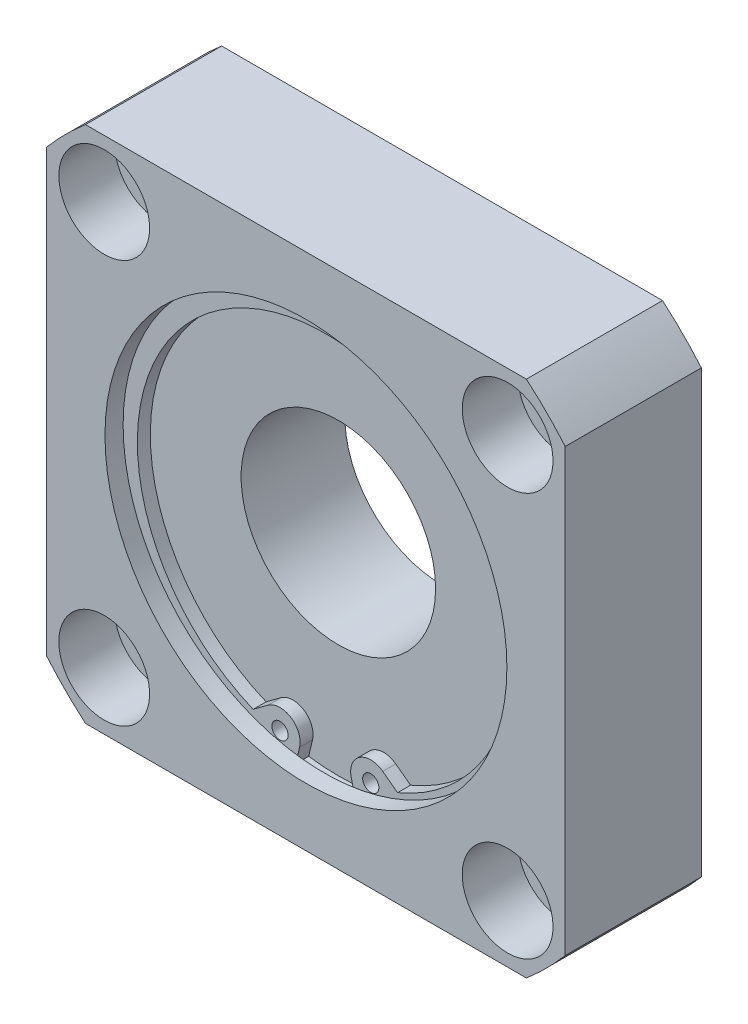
ISO-10303-21;
HEADER;
FILE_DESCRIPTION(('STEP AP214'),'2;1');
FILE_NAME('part.step','',(''),(''),'','','');
FILE_SCHEMA(('AUTOMOTIVE_DESIGN { 1 0 10303 214 1 1 1 1 }'));
ENDSEC;
DATA;
#1=APPLICATION_CONTEXT('core data for automotive mechanical design processes');
#2=APPLICATION_PROTOCOL_DEFINITION('international standard','automotive_design',2000,#1);
#3=PRODUCT_CONTEXT('',#1,'mechanical');
#4=PRODUCT('Part','Part','',(#3));
#5=PRODUCT_RELATED_PRODUCT_CATEGORY('part','',(#4));
#6=PRODUCT_DEFINITION_FORMATION('','',#4);
#7=PRODUCT_DEFINITION_CONTEXT('part definition',#1,'design');
#8=PRODUCT_DEFINITION('design','',#6,#7);
#9=PRODUCT_DEFINITION_SHAPE('','',#8);
#10=(LENGTH_UNIT() NAMED_UNIT(*) SI_UNIT(.MILLI.,.METRE.));
#11=(NAMED_UNIT(*) PLANE_ANGLE_UNIT() SI_UNIT($,.RADIAN.));
#12=(NAMED_UNIT(*) SI_UNIT($,.STERADIAN.) SOLID_ANGLE_UNIT());
#13=UNCERTAINTY_MEASURE_WITH_UNIT(LENGTH_MEASURE(1.E-05),#10,'distance_accuracy_value','');
#14=(GEOMETRIC_REPRESENTATION_CONTEXT(3) GLOBAL_UNCERTAINTY_ASSIGNED_CONTEXT((#13)) GLOBAL_UNIT_ASSIGNED_CONTEXT((#10,
#11,#12)) REPRESENTATION_CONTEXT('',''));
#15=CARTESIAN_POINT('',(0.,0.,0.));
#16=DIRECTION('',(0.,0.,1.));
#17=DIRECTION('',(1.,0.,0.));
#18=AXIS2_PLACEMENT_3D('',#15,#16,#17);
#19=CARTESIAN_POINT('',(31.1126983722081,31.1126983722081,0.));
#20=DIRECTION('',(0.,0.,1.));
#21=DIRECTION('',(1.,0.,0.));
#22=AXIS2_PLACEMENT_3D('',#19,#20,#21);
#23=CYLINDRICAL_SURFACE('',#22,5.);
#24=CARTESIAN_POINT('',(31.1126983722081,31.1126983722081,0.));
#25=DIRECTION('',(0.,0.,1.));
#26=DIRECTION('',(1.,0.,0.));
#27=AXIS2_PLACEMENT_3D('',#24,#25,#26);
#28=CIRCLE('',#27,5.);
#29=CARTESIAN_POINT('',(36.1126983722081,31.1126983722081,0.));
#30=VERTEX_POINT('',#29);
#31=EDGE_CURVE('E287',#30,#30,#28,.T.);
#32=ORIENTED_EDGE('',*,*,#31,.F.);
#33=EDGE_LOOP('',(#32));
#34=FACE_BOUND('',#33,.T.);
#35=CARTESIAN_POINT('',(31.1126983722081,31.1126983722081,12.4));
#36=DIRECTION('',(0.,0.,1.));
#37=DIRECTION('',(1.,0.,0.));
#38=AXIS2_PLACEMENT_3D('',#35,#36,#37);
#39=CIRCLE('',#38,5.);
#40=CARTESIAN_POINT('',(36.1126983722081,31.1126983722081,12.4));
#41=VERTEX_POINT('',#40);
#42=EDGE_CURVE('E286',#41,#41,#39,.F.);
#43=ORIENTED_EDGE('',*,*,#42,.F.);
#44=EDGE_LOOP('',(#43));
#45=FACE_BOUND('',#44,.T.);
#46=ADVANCED_FACE('F14',(#34,#45),#23,.F.);
#47=CARTESIAN_POINT('',(31.112698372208,-31.1126983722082,0.));
#48=DIRECTION('',(0.,0.,1.));
#49=DIRECTION('',(1.,0.,0.));
#50=AXIS2_PLACEMENT_3D('',#47,#48,#49);
#51=CYLINDRICAL_SURFACE('',#50,5.);
#52=CARTESIAN_POINT('',(31.112698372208,-31.1126983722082,0.));
#53=DIRECTION('',(0.,0.,1.));
#54=DIRECTION('',(0.,-1.,0.));
#55=AXIS2_PLACEMENT_3D('',#52,#53,#54);
#56=CIRCLE('',#55,5.);
#57=CARTESIAN_POINT('',(31.112698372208,-36.1126983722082,0.));
#58=VERTEX_POINT('',#57);
#59=EDGE_CURVE('E277',#58,#58,#56,.T.);
#60=ORIENTED_EDGE('',*,*,#59,.F.);
#61=EDGE_LOOP('',(#60));
#62=FACE_BOUND('',#61,.T.);
#63=CARTESIAN_POINT('',(31.112698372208,-31.1126983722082,12.4));
#64=DIRECTION('',(0.,0.,1.));
#65=DIRECTION('',(1.,0.,0.));
#66=AXIS2_PLACEMENT_3D('',#63,#64,#65);
#67=CIRCLE('',#66,5.);
#68=CARTESIAN_POINT('',(36.112698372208,-31.1126983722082,12.4));
#69=VERTEX_POINT('',#68);
#70=EDGE_CURVE('E270',#69,#69,#67,.F.);
#71=ORIENTED_EDGE('',*,*,#70,.F.);
#72=EDGE_LOOP('',(#71));
#73=FACE_BOUND('',#72,.T.);
#74=ADVANCED_FACE('F434',(#62,#73),#51,.F.);
#75=CARTESIAN_POINT('',(-31.1126983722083,-31.1126983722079,0.));
#76=DIRECTION('',(0.,0.,1.));
#77=DIRECTION('',(1.,0.,0.));
#78=AXIS2_PLACEMENT_3D('',#75,#76,#77);
#79=CYLINDRICAL_SURFACE('',#78,5.);
#80=CARTESIAN_POINT('',(-31.1126983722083,-31.1126983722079,0.));
#81=DIRECTION('',(0.,0.,1.));
#82=DIRECTION('',(-1.,0.,0.));
#83=AXIS2_PLACEMENT_3D('',#80,#81,#82);
#84=CIRCLE('',#83,5.);
#85=CARTESIAN_POINT('',(-36.1126983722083,-31.1126983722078,0.));
#86=VERTEX_POINT('',#85);
#87=EDGE_CURVE('E274',#86,#86,#84,.T.);
#88=ORIENTED_EDGE('',*,*,#87,.F.);
#89=EDGE_LOOP('',(#88));
#90=FACE_BOUND('',#89,.T.);
#91=CARTESIAN_POINT('',(-31.1126983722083,-31.1126983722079,12.4));
#92=DIRECTION('',(0.,0.,1.));
#93=DIRECTION('',(1.,0.,0.));
#94=AXIS2_PLACEMENT_3D('',#91,#92,#93);
#95=CIRCLE('',#94,5.);
#96=CARTESIAN_POINT('',(-26.1126983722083,-31.1126983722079,12.4));
#97=VERTEX_POINT('',#96);
#98=EDGE_CURVE('E263',#97,#97,#95,.F.);
#99=ORIENTED_EDGE('',*,*,#98,.F.);
#100=EDGE_LOOP('',(#99));
#101=FACE_BOUND('',#100,.T.);
#102=ADVANCED_FACE('F440',(#90,#101),#79,.F.);
#103=CARTESIAN_POINT('',(-31.1126983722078,31.1126983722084,0.));
#104=DIRECTION('',(0.,0.,1.));
#105=DIRECTION('',(1.,0.,0.));
#106=AXIS2_PLACEMENT_3D('',#103,#104,#105);
#107=CYLINDRICAL_SURFACE('',#106,5.);
#108=CARTESIAN_POINT('',(-31.1126983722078,31.1126983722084,0.));
#109=DIRECTION('',(0.,0.,1.));
#110=DIRECTION('',(0.,1.,0.));
#111=AXIS2_PLACEMENT_3D('',#108,#109,#110);
#112=CIRCLE('',#111,5.);
#113=CARTESIAN_POINT('',(-31.1126983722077,36.1126983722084,0.));
#114=VERTEX_POINT('',#113);
#115=EDGE_CURVE('E271',#114,#114,#112,.T.);
#116=ORIENTED_EDGE('',*,*,#115,.F.);
#117=EDGE_LOOP('',(#116));
#118=FACE_BOUND('',#117,.T.);
#119=CARTESIAN_POINT('',(-31.1126983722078,31.1126983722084,12.4));
#120=DIRECTION('',(0.,0.,1.));
#121=DIRECTION('',(1.,0.,0.));
#122=AXIS2_PLACEMENT_3D('',#119,#120,#121);
#123=CIRCLE('',#122,5.);
#124=CARTESIAN_POINT('',(-26.1126983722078,31.1126983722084,12.4));
#125=VERTEX_POINT('',#124);
#126=EDGE_CURVE('E256',#125,#125,#123,.F.);
#127=ORIENTED_EDGE('',*,*,#126,.F.);
#128=EDGE_LOOP('',(#127));
#129=FACE_BOUND('',#128,.T.);
#130=ADVANCED_FACE('F801',(#118,#129),#107,.F.);
#131=CARTESIAN_POINT('',(0.,0.,-5.));
#132=DIRECTION('',(0.,0.,1.));
#133=DIRECTION('',(1.,0.,0.));
#134=AXIS2_PLACEMENT_3D('',#131,#132,#133);
#135=CYLINDRICAL_SURFACE('',#134,35.);
#136=CARTESIAN_POINT('',(0.,0.,-5.));
#137=DIRECTION('',(0.,0.,-1.));
#138=DIRECTION('',(-1.,0.,0.));
#139=AXIS2_PLACEMENT_3D('',#136,#137,#138);
#140=CIRCLE('',#139,35.);
#141=CARTESIAN_POINT('',(-35.,0.,-5.));
#142=VERTEX_POINT('',#141);
#143=EDGE_CURVE('E238',#142,#142,#140,.T.);
#144=ORIENTED_EDGE('',*,*,#143,.F.);
#145=EDGE_LOOP('',(#144));
#146=FACE_BOUND('',#145,.T.);
#147=CARTESIAN_POINT('',(0.,0.,0.));
#148=DIRECTION('',(0.,0.,-1.));
#149=DIRECTION('',(-1.,0.,0.));
#150=AXIS2_PLACEMENT_3D('',#147,#148,#149);
#151=CIRCLE('',#150,35.);
#152=CARTESIAN_POINT('',(-35.,0.,0.));
#153=VERTEX_POINT('',#152);
#154=EDGE_CURVE('E239',#153,#153,#151,.T.);
#155=ORIENTED_EDGE('',*,*,#154,.T.);
#156=EDGE_LOOP('',(#155));
#157=FACE_BOUND('',#156,.T.);
#158=ADVANCED_FACE('F458',(#146,#157),#135,.T.);
#159=CARTESIAN_POINT('',(0.,0.,0.));
#160=DIRECTION('',(0.,0.,-1.));
#161=DIRECTION('',(-1.,0.,0.));
#162=AXIS2_PLACEMENT_3D('',#159,#160,#161);
#163=PLANE('',#162);
#164=ORIENTED_EDGE('',*,*,#154,.F.);
#165=EDGE_LOOP('',(#164));
#166=FACE_BOUND('',#165,.T.);
#167=ORIENTED_EDGE('',*,*,#115,.T.);
#168=EDGE_LOOP('',(#167));
#169=FACE_BOUND('',#168,.T.);
#170=ORIENTED_EDGE('',*,*,#87,.T.);
#171=EDGE_LOOP('',(#170));
#172=FACE_BOUND('',#171,.T.);
#173=ORIENTED_EDGE('',*,*,#59,.T.);
#174=EDGE_LOOP('',(#173));
#175=FACE_BOUND('',#174,.T.);
#176=ORIENTED_EDGE('',*,*,#31,.T.);
#177=EDGE_LOOP('',(#176));
#178=FACE_BOUND('',#177,.T.);
#179=CARTESIAN_POINT('',(0.,0.,0.));
#180=DIRECTION('',(0.,0.,-1.));
#181=DIRECTION('',(-1.,0.,0.));
#182=AXIS2_PLACEMENT_3D('',#179,#180,#181);
#183=CIRCLE('',#182,52.5);
#184=CARTESIAN_POINT('',(40.,-34.0036762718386,0.));
#185=VERTEX_POINT('',#184);
#186=CARTESIAN_POINT('',(34.0036762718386,-40.,0.));
#187=VERTEX_POINT('',#186);
#188=EDGE_CURVE('E293',#185,#187,#183,.T.);
#189=ORIENTED_EDGE('',*,*,#188,.T.);
#190=DIRECTION('',(1.,0.,0.));
#191=VECTOR('',#190,1.);
#192=CARTESIAN_POINT('',(-34.0036762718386,-40.,0.));
#193=LINE('',#192,#191);
#194=CARTESIAN_POINT('',(-34.0036762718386,-40.,0.));
#195=VERTEX_POINT('',#194);
#196=EDGE_CURVE('E295',#195,#187,#193,.T.);
#197=ORIENTED_EDGE('',*,*,#196,.F.);
#198=CARTESIAN_POINT('',(0.,0.,0.));
#199=DIRECTION('',(0.,0.,1.));
#200=DIRECTION('',(1.,0.,0.));
#201=AXIS2_PLACEMENT_3D('',#198,#199,#200);
#202=CIRCLE('',#201,52.5);
#203=CARTESIAN_POINT('',(-40.,-34.0036762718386,0.));
#204=VERTEX_POINT('',#203);
#205=EDGE_CURVE('E298',#204,#195,#202,.T.);
#206=ORIENTED_EDGE('',*,*,#205,.F.);
#207=DIRECTION('',(0.,-1.,0.));
#208=VECTOR('',#207,1.);
#209=CARTESIAN_POINT('',(-40.,34.0036762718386,0.));
#210=LINE('',#209,#208);
#211=CARTESIAN_POINT('',(-40.,34.0036762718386,0.));
#212=VERTEX_POINT('',#211);
#213=EDGE_CURVE('E301',#212,#204,#210,.T.);
#214=ORIENTED_EDGE('',*,*,#213,.F.);
#215=CARTESIAN_POINT('',(0.,0.,0.));
#216=DIRECTION('',(0.,0.,-1.));
#217=DIRECTION('',(-1.,0.,0.));
#218=AXIS2_PLACEMENT_3D('',#215,#216,#217);
#219=CIRCLE('',#218,52.5);
#220=CARTESIAN_POINT('',(-34.0036762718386,40.,0.));
#221=VERTEX_POINT('',#220);
#222=EDGE_CURVE('E304',#212,#221,#219,.T.);
#223=ORIENTED_EDGE('',*,*,#222,.T.);
#224=DIRECTION('',(1.,0.,0.));
#225=VECTOR('',#224,1.);
#226=CARTESIAN_POINT('',(-34.0036762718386,40.,0.));
#227=LINE('',#226,#225);
#228=CARTESIAN_POINT('',(34.0036762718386,40.,0.));
#229=VERTEX_POINT('',#228);
#230=EDGE_CURVE('E307',#221,#229,#227,.T.);
#231=ORIENTED_EDGE('',*,*,#230,.T.);
#232=CARTESIAN_POINT('',(0.,0.,0.));
#233=DIRECTION('',(0.,0.,1.));
#234=DIRECTION('',(1.,0.,0.));
#235=AXIS2_PLACEMENT_3D('',#232,#233,#234);
#236=CIRCLE('',#235,52.5);
#237=CARTESIAN_POINT('',(40.,34.0036762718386,0.));
#238=VERTEX_POINT('',#237);
#239=EDGE_CURVE('E310',#238,#229,#236,.T.);
#240=ORIENTED_EDGE('',*,*,#239,.F.);
#241=DIRECTION('',(0.,-1.,0.));
#242=VECTOR('',#241,1.);
#243=CARTESIAN_POINT('',(40.,34.0036762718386,0.));
#244=LINE('',#243,#242);
#245=EDGE_CURVE('E313',#238,#185,#244,.T.);
#246=ORIENTED_EDGE('',*,*,#245,.T.);
#247=EDGE_LOOP('',(#189,#197,#206,#214,#223,#231,#240,#246));
#248=FACE_BOUND('',#247,.T.);
#249=ADVANCED_FACE('F454',(#166,#169,#172,#175,#178,#248),#163,.T.);
#250=CARTESIAN_POINT('',(31.1126983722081,31.1126983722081,12.4));
#251=DIRECTION('',(0.,0.,1.));
#252=DIRECTION('',(1.,0.,0.));
#253=AXIS2_PLACEMENT_3D('',#250,#251,#252);
#254=PLANE('',#253);
#255=CARTESIAN_POINT('',(31.1126983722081,31.1126983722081,12.4));
#256=DIRECTION('',(0.,0.,1.));
#257=DIRECTION('',(1.,0.,0.));
#258=AXIS2_PLACEMENT_3D('',#255,#256,#257);
#259=CIRCLE('',#258,7.);
#260=CARTESIAN_POINT('',(38.1126983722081,31.1126983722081,12.4));
#261=VERTEX_POINT('',#260);
#262=EDGE_CURVE('E283',#261,#261,#259,.T.);
#263=ORIENTED_EDGE('',*,*,#262,.T.);
#264=EDGE_LOOP('',(#263));
#265=FACE_BOUND('',#264,.T.);
#266=ORIENTED_EDGE('',*,*,#42,.T.);
#267=EDGE_LOOP('',(#266));
#268=FACE_BOUND('',#267,.T.);
#269=ADVANCED_FACE('F457',(#265,#268),#254,.T.);
#270=CARTESIAN_POINT('',(31.112698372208,-31.1126983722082,12.4));
#271=DIRECTION('',(0.,0.,1.));
#272=DIRECTION('',(0.,-1.,0.));
#273=AXIS2_PLACEMENT_3D('',#270,#271,#272);
#274=PLANE('',#273);
#275=CARTESIAN_POINT('',(31.112698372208,-31.1126983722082,12.4));
#276=DIRECTION('',(0.,0.,1.));
#277=DIRECTION('',(0.,-1.,0.));
#278=AXIS2_PLACEMENT_3D('',#275,#276,#277);
#279=CIRCLE('',#278,7.);
#280=CARTESIAN_POINT('',(31.112698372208,-38.1126983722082,12.4));
#281=VERTEX_POINT('',#280);
#282=EDGE_CURVE('E267',#281,#281,#279,.T.);
#283=ORIENTED_EDGE('',*,*,#282,.T.);
#284=EDGE_LOOP('',(#283));
#285=FACE_BOUND('',#284,.T.);
#286=ORIENTED_EDGE('',*,*,#70,.T.);
#287=EDGE_LOOP('',(#286));
#288=FACE_BOUND('',#287,.T.);
#289=ADVANCED_FACE('F772',(#285,#288),#274,.T.);
#290=CARTESIAN_POINT('',(-31.1126983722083,-31.1126983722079,12.4));
#291=DIRECTION('',(0.,0.,1.));
#292=DIRECTION('',(-1.,0.,0.));
#293=AXIS2_PLACEMENT_3D('',#290,#291,#292);
#294=PLANE('',#293);
#295=CARTESIAN_POINT('',(-31.1126983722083,-31.1126983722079,12.4));
#296=DIRECTION('',(0.,0.,1.));
#297=DIRECTION('',(-1.,0.,0.));
#298=AXIS2_PLACEMENT_3D('',#295,#296,#297);
#299=CIRCLE('',#298,7.);
#300=CARTESIAN_POINT('',(-38.1126983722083,-31.1126983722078,12.4));
#301=VERTEX_POINT('',#300);
#302=EDGE_CURVE('E260',#301,#301,#299,.T.);
#303=ORIENTED_EDGE('',*,*,#302,.T.);
#304=EDGE_LOOP('',(#303));
#305=FACE_BOUND('',#304,.T.);
#306=ORIENTED_EDGE('',*,*,#98,.T.);
#307=EDGE_LOOP('',(#306));
#308=FACE_BOUND('',#307,.T.);
#309=ADVANCED_FACE('F763',(#305,#308),#294,.T.);
#310=CARTESIAN_POINT('',(-31.1126983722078,31.1126983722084,12.4));
#311=DIRECTION('',(0.,0.,1.));
#312=DIRECTION('',(0.,1.,0.));
#313=AXIS2_PLACEMENT_3D('',#310,#311,#312);
#314=PLANE('',#313);
#315=CARTESIAN_POINT('',(-31.1126983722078,31.1126983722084,12.4));
#316=DIRECTION('',(0.,0.,1.));
#317=DIRECTION('',(0.,1.,0.));
#318=AXIS2_PLACEMENT_3D('',#315,#316,#317);
#319=CIRCLE('',#318,7.);
#320=CARTESIAN_POINT('',(-31.1126983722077,38.1126983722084,12.4));
#321=VERTEX_POINT('',#320);
#322=EDGE_CURVE('E253',#321,#321,#319,.T.);
#323=ORIENTED_EDGE('',*,*,#322,.T.);
#324=EDGE_LOOP('',(#323));
#325=FACE_BOUND('',#324,.T.);
#326=ORIENTED_EDGE('',*,*,#126,.T.);
#327=EDGE_LOOP('',(#326));
#328=FACE_BOUND('',#327,.T.);
#329=ADVANCED_FACE('F754',(#325,#328),#314,.T.);
#330=CARTESIAN_POINT('',(0.,0.,-5.));
#331=DIRECTION('',(0.,0.,-1.));
#332=DIRECTION('',(-1.,0.,0.));
#333=AXIS2_PLACEMENT_3D('',#330,#331,#332);
#334=PLANE('',#333);
#335=ORIENTED_EDGE('',*,*,#143,.T.);
#336=EDGE_LOOP('',(#335));
#337=FACE_BOUND('',#336,.T.);
#338=CARTESIAN_POINT('',(0.,0.,-5.));
#339=DIRECTION('',(0.,0.,-1.));
#340=DIRECTION('',(-1.,0.,0.));
#341=AXIS2_PLACEMENT_3D('',#338,#339,#340);
#342=CIRCLE('',#341,27.5);
#343=CARTESIAN_POINT('',(-27.5,0.,-5.));
#344=VERTEX_POINT('',#343);
#345=EDGE_CURVE('E235',#344,#344,#342,.T.);
#346=ORIENTED_EDGE('',*,*,#345,.F.);
#347=EDGE_LOOP('',(#346));
#348=FACE_BOUND('',#347,.T.);
#349=ADVANCED_FACE('F474',(#337,#348),#334,.T.);
#350=CARTESIAN_POINT('',(-34.0036762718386,-40.,21.));
#351=DIRECTION('',(0.,1.,0.));
#352=DIRECTION('',(0.,0.,1.));
#353=AXIS2_PLACEMENT_3D('',#350,#351,#352);
#354=PLANE('',#353);
#355=DIRECTION('',(1.,0.,0.));
#356=VECTOR('',#355,1.);
#357=CARTESIAN_POINT('',(-34.0036762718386,-40.,21.));
#358=LINE('',#357,#356);
#359=CARTESIAN_POINT('',(-34.0036762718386,-40.,21.));
#360=VERTEX_POINT('',#359);
#361=CARTESIAN_POINT('',(34.0036762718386,-40.,21.));
#362=VERTEX_POINT('',#361);
#363=EDGE_CURVE('E318',#360,#362,#358,.T.);
#364=ORIENTED_EDGE('',*,*,#363,.F.);
#365=DIRECTION('',(0.,0.,-1.));
#366=VECTOR('',#365,1.);
#367=CARTESIAN_POINT('',(-34.0036762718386,-40.,21.));
#368=LINE('',#367,#366);
#369=EDGE_CURVE('E340',#360,#195,#368,.T.);
#370=ORIENTED_EDGE('',*,*,#369,.T.);
#371=ORIENTED_EDGE('',*,*,#196,.T.);
#372=DIRECTION('',(0.,0.,-1.));
#373=VECTOR('',#372,1.);
#374=CARTESIAN_POINT('',(34.0036762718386,-40.,21.));
#375=LINE('',#374,#373);
#376=EDGE_CURVE('E74',#362,#187,#375,.T.);
#377=ORIENTED_EDGE('',*,*,#376,.F.);
#378=EDGE_LOOP('',(#364,#370,#371,#377));
#379=FACE_BOUND('',#378,.T.);
#380=ADVANCED_FACE('F470',(#379),#354,.F.);
#381=CARTESIAN_POINT('',(0.,0.,21.));
#382=DIRECTION('',(0.,0.,-1.));
#383=DIRECTION('',(-1.,0.,0.));
#384=AXIS2_PLACEMENT_3D('',#381,#382,#383);
#385=CYLINDRICAL_SURFACE('',#384,52.5);
#386=ORIENTED_EDGE('',*,*,#369,.F.);
#387=CARTESIAN_POINT('',(0.,0.,21.));
#388=DIRECTION('',(0.,0.,1.));
#389=DIRECTION('',(1.,0.,0.));
#390=AXIS2_PLACEMENT_3D('',#387,#388,#389);
#391=CIRCLE('',#390,52.5);
#392=CARTESIAN_POINT('',(-40.,-34.0036762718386,21.));
#393=VERTEX_POINT('',#392);
#394=EDGE_CURVE('E321',#393,#360,#391,.T.);
#395=ORIENTED_EDGE('',*,*,#394,.F.);
#396=DIRECTION('',(0.,0.,-1.));
#397=VECTOR('',#396,1.);
#398=CARTESIAN_POINT('',(-40.,-34.0036762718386,21.));
#399=LINE('',#398,#397);
#400=EDGE_CURVE('E342',#393,#204,#399,.T.);
#401=ORIENTED_EDGE('',*,*,#400,.T.);
#402=ORIENTED_EDGE('',*,*,#205,.T.);
#403=EDGE_LOOP('',(#386,#395,#401,#402));
#404=FACE_BOUND('',#403,.T.);
#405=ADVANCED_FACE('F473',(#404),#385,.T.);
#406=CARTESIAN_POINT('',(-40.,34.0036762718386,21.));
#407=DIRECTION('',(1.,0.,0.));
#408=DIRECTION('',(0.,0.,-1.));
#409=AXIS2_PLACEMENT_3D('',#406,#407,#408);
#410=PLANE('',#409);
#411=ORIENTED_EDGE('',*,*,#400,.F.);
#412=DIRECTION('',(0.,-1.,0.));
#413=VECTOR('',#412,1.);
#414=CARTESIAN_POINT('',(-40.,34.0036762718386,21.));
#415=LINE('',#414,#413);
#416=CARTESIAN_POINT('',(-40.,34.0036762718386,21.));
#417=VERTEX_POINT('',#416);
#418=EDGE_CURVE('E324',#417,#393,#415,.T.);
#419=ORIENTED_EDGE('',*,*,#418,.F.);
#420=DIRECTION('',(0.,0.,-1.));
#421=VECTOR('',#420,1.);
#422=CARTESIAN_POINT('',(-40.,34.0036762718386,21.));
#423=LINE('',#422,#421);
#424=EDGE_CURVE('E344',#417,#212,#423,.T.);
#425=ORIENTED_EDGE('',*,*,#424,.T.);
#426=ORIENTED_EDGE('',*,*,#213,.T.);
#427=EDGE_LOOP('',(#411,#419,#425,#426));
#428=FACE_BOUND('',#427,.T.);
#429=ADVANCED_FACE('F478',(#428),#410,.F.);
#430=CARTESIAN_POINT('',(0.,0.,21.));
#431=DIRECTION('',(0.,0.,-1.));
#432=DIRECTION('',(-1.,0.,0.));
#433=AXIS2_PLACEMENT_3D('',#430,#431,#432);
#434=CYLINDRICAL_SURFACE('',#433,52.5);
#435=ORIENTED_EDGE('',*,*,#424,.F.);
#436=CARTESIAN_POINT('',(0.,0.,21.));
#437=DIRECTION('',(0.,0.,-1.));
#438=DIRECTION('',(-1.,0.,0.));
#439=AXIS2_PLACEMENT_3D('',#436,#437,#438);
#440=CIRCLE('',#439,52.5);
#441=CARTESIAN_POINT('',(-34.0036762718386,40.,21.));
#442=VERTEX_POINT('',#441);
#443=EDGE_CURVE('E327',#417,#442,#440,.T.);
#444=ORIENTED_EDGE('',*,*,#443,.T.);
#445=DIRECTION('',(0.,0.,-1.));
#446=VECTOR('',#445,1.);
#447=CARTESIAN_POINT('',(-34.0036762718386,40.,21.));
#448=LINE('',#447,#446);
#449=EDGE_CURVE('E346',#442,#221,#448,.T.);
#450=ORIENTED_EDGE('',*,*,#449,.T.);
#451=ORIENTED_EDGE('',*,*,#222,.F.);
#452=EDGE_LOOP('',(#435,#444,#450,#451));
#453=FACE_BOUND('',#452,.T.);
#454=ADVANCED_FACE('F482',(#453),#434,.T.);
#455=CARTESIAN_POINT('',(-34.0036762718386,40.,21.));
#456=DIRECTION('',(0.,1.,0.));
#457=DIRECTION('',(0.,0.,1.));
#458=AXIS2_PLACEMENT_3D('',#455,#456,#457);
#459=PLANE('',#458);
#460=ORIENTED_EDGE('',*,*,#449,.F.);
#461=DIRECTION('',(1.,0.,0.));
#462=VECTOR('',#461,1.);
#463=CARTESIAN_POINT('',(-34.0036762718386,40.,21.));
#464=LINE('',#463,#462);
#465=CARTESIAN_POINT('',(34.0036762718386,40.,21.));
#466=VERTEX_POINT('',#465);
#467=EDGE_CURVE('E330',#442,#466,#464,.T.);
#468=ORIENTED_EDGE('',*,*,#467,.T.);
#469=DIRECTION('',(0.,0.,-1.));
#470=VECTOR('',#469,1.);
#471=CARTESIAN_POINT('',(34.0036762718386,40.,21.));
#472=LINE('',#471,#470);
#473=EDGE_CURVE('E348',#466,#229,#472,.T.);
#474=ORIENTED_EDGE('',*,*,#473,.T.);
#475=ORIENTED_EDGE('',*,*,#230,.F.);
#476=EDGE_LOOP('',(#460,#468,#474,#475));
#477=FACE_BOUND('',#476,.T.);
#478=ADVANCED_FACE('F486',(#477),#459,.T.);
#479=CARTESIAN_POINT('',(0.,0.,21.));
#480=DIRECTION('',(0.,0.,-1.));
#481=DIRECTION('',(-1.,0.,0.));
#482=AXIS2_PLACEMENT_3D('',#479,#480,#481);
#483=CYLINDRICAL_SURFACE('',#482,52.5);
#484=ORIENTED_EDGE('',*,*,#473,.F.);
#485=CARTESIAN_POINT('',(0.,0.,21.));
#486=DIRECTION('',(0.,0.,1.));
#487=DIRECTION('',(1.,0.,0.));
#488=AXIS2_PLACEMENT_3D('',#485,#486,#487);
#489=CIRCLE('',#488,52.5);
#490=CARTESIAN_POINT('',(40.,34.0036762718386,21.));
#491=VERTEX_POINT('',#490);
#492=EDGE_CURVE('E333',#491,#466,#489,.T.);
#493=ORIENTED_EDGE('',*,*,#492,.F.);
#494=DIRECTION('',(0.,0.,-1.));
#495=VECTOR('',#494,1.);
#496=CARTESIAN_POINT('',(40.,34.0036762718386,21.));
#497=LINE('',#496,#495);
#498=EDGE_CURVE('E350',#491,#238,#497,.T.);
#499=ORIENTED_EDGE('',*,*,#498,.T.);
#500=ORIENTED_EDGE('',*,*,#239,.T.);
#501=EDGE_LOOP('',(#484,#493,#499,#500));
#502=FACE_BOUND('',#501,.T.);
#503=ADVANCED_FACE('F490',(#502),#483,.T.);
#504=CARTESIAN_POINT('',(40.,34.0036762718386,21.));
#505=DIRECTION('',(1.,0.,0.));
#506=DIRECTION('',(0.,0.,-1.));
#507=AXIS2_PLACEMENT_3D('',#504,#505,#506);
#508=PLANE('',#507);
#509=ORIENTED_EDGE('',*,*,#498,.F.);
#510=DIRECTION('',(0.,-1.,0.));
#511=VECTOR('',#510,1.);
#512=CARTESIAN_POINT('',(40.,34.0036762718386,21.));
#513=LINE('',#512,#511);
#514=CARTESIAN_POINT('',(40.,-34.0036762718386,21.));
#515=VERTEX_POINT('',#514);
#516=EDGE_CURVE('E336',#491,#515,#513,.T.);
#517=ORIENTED_EDGE('',*,*,#516,.T.);
#518=DIRECTION('',(0.,0.,-1.));
#519=VECTOR('',#518,1.);
#520=CARTESIAN_POINT('',(40.,-34.0036762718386,21.));
#521=LINE('',#520,#519);
#522=EDGE_CURVE('E243',#515,#185,#521,.T.);
#523=ORIENTED_EDGE('',*,*,#522,.T.);
#524=ORIENTED_EDGE('',*,*,#245,.F.);
#525=EDGE_LOOP('',(#509,#517,#523,#524));
#526=FACE_BOUND('',#525,.T.);
#527=ADVANCED_FACE('F469',(#526),#508,.T.);
#528=CARTESIAN_POINT('',(0.,0.,21.));
#529=DIRECTION('',(0.,0.,-1.));
#530=DIRECTION('',(-1.,0.,0.));
#531=AXIS2_PLACEMENT_3D('',#528,#529,#530);
#532=CYLINDRICAL_SURFACE('',#531,52.5);
#533=ORIENTED_EDGE('',*,*,#522,.F.);
#534=CARTESIAN_POINT('',(0.,0.,21.));
#535=DIRECTION('',(0.,0.,-1.));
#536=DIRECTION('',(-1.,0.,0.));
#537=AXIS2_PLACEMENT_3D('',#534,#535,#536);
#538=CIRCLE('',#537,52.5);
#539=EDGE_CURVE('E316',#515,#362,#538,.T.);
#540=ORIENTED_EDGE('',*,*,#539,.T.);
#541=ORIENTED_EDGE('',*,*,#376,.T.);
#542=ORIENTED_EDGE('',*,*,#188,.F.);
#543=EDGE_LOOP('',(#533,#540,#541,#542));
#544=FACE_BOUND('',#543,.T.);
#545=ADVANCED_FACE('F466',(#544),#532,.T.);
#546=CARTESIAN_POINT('',(31.1126983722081,31.1126983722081,12.4));
#547=DIRECTION('',(0.,0.,1.));
#548=DIRECTION('',(1.,0.,0.));
#549=AXIS2_PLACEMENT_3D('',#546,#547,#548);
#550=CYLINDRICAL_SURFACE('',#549,7.);
#551=ORIENTED_EDGE('',*,*,#262,.F.);
#552=EDGE_LOOP('',(#551));
#553=FACE_BOUND('',#552,.T.);
#554=CARTESIAN_POINT('',(31.1126983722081,31.1126983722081,21.));
#555=DIRECTION('',(0.,0.,1.));
#556=DIRECTION('',(1.,0.,0.));
#557=AXIS2_PLACEMENT_3D('',#554,#555,#556);
#558=CIRCLE('',#557,7.);
#559=CARTESIAN_POINT('',(38.1126983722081,31.1126983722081,21.));
#560=VERTEX_POINT('',#559);
#561=EDGE_CURVE('E280',#560,#560,#558,.T.);
#562=ORIENTED_EDGE('',*,*,#561,.T.);
#563=EDGE_LOOP('',(#562));
#564=FACE_BOUND('',#563,.T.);
#565=ADVANCED_FACE('F447',(#553,#564),#550,.F.);
#566=CARTESIAN_POINT('',(31.112698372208,-31.1126983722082,12.4));
#567=DIRECTION('',(0.,0.,1.));
#568=DIRECTION('',(1.,0.,0.));
#569=AXIS2_PLACEMENT_3D('',#566,#567,#568);
#570=CYLINDRICAL_SURFACE('',#569,7.);
#571=ORIENTED_EDGE('',*,*,#282,.F.);
#572=EDGE_LOOP('',(#571));
#573=FACE_BOUND('',#572,.T.);
#574=CARTESIAN_POINT('',(31.112698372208,-31.1126983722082,21.));
#575=DIRECTION('',(0.,0.,1.));
#576=DIRECTION('',(0.,-1.,0.));
#577=AXIS2_PLACEMENT_3D('',#574,#575,#576);
#578=CIRCLE('',#577,7.);
#579=CARTESIAN_POINT('',(31.112698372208,-38.1126983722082,21.));
#580=VERTEX_POINT('',#579);
#581=EDGE_CURVE('E264',#580,#580,#578,.T.);
#582=ORIENTED_EDGE('',*,*,#581,.T.);
#583=EDGE_LOOP('',(#582));
#584=FACE_BOUND('',#583,.T.);
#585=ADVANCED_FACE('F678',(#573,#584),#570,.F.);
#586=CARTESIAN_POINT('',(-31.1126983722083,-31.1126983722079,12.4));
#587=DIRECTION('',(0.,0.,1.));
#588=DIRECTION('',(1.,0.,0.));
#589=AXIS2_PLACEMENT_3D('',#586,#587,#588);
#590=CYLINDRICAL_SURFACE('',#589,7.);
#591=ORIENTED_EDGE('',*,*,#302,.F.);
#592=EDGE_LOOP('',(#591));
#593=FACE_BOUND('',#592,.T.);
#594=CARTESIAN_POINT('',(-31.1126983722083,-31.1126983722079,21.));
#595=DIRECTION('',(0.,0.,1.));
#596=DIRECTION('',(-1.,0.,0.));
#597=AXIS2_PLACEMENT_3D('',#594,#595,#596);
#598=CIRCLE('',#597,7.);
#599=CARTESIAN_POINT('',(-38.1126983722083,-31.1126983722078,21.));
#600=VERTEX_POINT('',#599);
#601=EDGE_CURVE('E257',#600,#600,#598,.T.);
#602=ORIENTED_EDGE('',*,*,#601,.T.);
#603=EDGE_LOOP('',(#602));
#604=FACE_BOUND('',#603,.T.);
#605=ADVANCED_FACE('F666',(#593,#604),#590,.F.);
#606=CARTESIAN_POINT('',(-31.1126983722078,31.1126983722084,12.4));
#607=DIRECTION('',(0.,0.,1.));
#608=DIRECTION('',(1.,0.,0.));
#609=AXIS2_PLACEMENT_3D('',#606,#607,#608);
#610=CYLINDRICAL_SURFACE('',#609,7.);
#611=ORIENTED_EDGE('',*,*,#322,.F.);
#612=EDGE_LOOP('',(#611));
#613=FACE_BOUND('',#612,.T.);
#614=CARTESIAN_POINT('',(-31.1126983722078,31.1126983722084,21.));
#615=DIRECTION('',(0.,0.,1.));
#616=DIRECTION('',(0.,1.,0.));
#617=AXIS2_PLACEMENT_3D('',#614,#615,#616);
#618=CIRCLE('',#617,7.);
#619=CARTESIAN_POINT('',(-31.1126983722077,38.1126983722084,21.));
#620=VERTEX_POINT('',#619);
#621=EDGE_CURVE('E250',#620,#620,#618,.T.);
#622=ORIENTED_EDGE('',*,*,#621,.T.);
#623=EDGE_LOOP('',(#622));
#624=FACE_BOUND('',#623,.T.);
#625=ADVANCED_FACE('F655',(#613,#624),#610,.F.);
#626=CARTESIAN_POINT('',(0.,0.,-5.));
#627=DIRECTION('',(0.,0.,1.));
#628=DIRECTION('',(1.,0.,0.));
#629=AXIS2_PLACEMENT_3D('',#626,#627,#628);
#630=CYLINDRICAL_SURFACE('',#629,27.5);
#631=ORIENTED_EDGE('',*,*,#345,.T.);
#632=EDGE_LOOP('',(#631));
#633=FACE_BOUND('',#632,.T.);
#634=CARTESIAN_POINT('',(0.,0.,0.));
#635=DIRECTION('',(0.,0.,-1.));
#636=DIRECTION('',(-1.,0.,0.));
#637=AXIS2_PLACEMENT_3D('',#634,#635,#636);
#638=CIRCLE('',#637,27.5);
#639=CARTESIAN_POINT('',(-27.5,0.,0.));
#640=VERTEX_POINT('',#639);
#641=EDGE_CURVE('E232',#640,#640,#638,.T.);
#642=ORIENTED_EDGE('',*,*,#641,.F.);
#643=EDGE_LOOP('',(#642));
#644=FACE_BOUND('',#643,.T.);
#645=ADVANCED_FACE('F464',(#633,#644),#630,.F.);
#646=CARTESIAN_POINT('',(0.,0.,21.));
#647=DIRECTION('',(0.,0.,-1.));
#648=DIRECTION('',(-1.,0.,0.));
#649=AXIS2_PLACEMENT_3D('',#646,#647,#648);
#650=PLANE('',#649);
#651=CARTESIAN_POINT('',(0.,0.,21.));
#652=DIRECTION('',(0.,0.,1.));
#653=DIRECTION('',(1.,0.,0.));
#654=AXIS2_PLACEMENT_3D('',#651,#652,#653);
#655=CIRCLE('',#654,31.);
#656=CARTESIAN_POINT('',(31.,0.,21.));
#657=VERTEX_POINT('',#656);
#658=EDGE_CURVE('E246',#657,#657,#655,.T.);
#659=ORIENTED_EDGE('',*,*,#658,.F.);
#660=EDGE_LOOP('',(#659));
#661=FACE_BOUND('',#660,.T.);
#662=ORIENTED_EDGE('',*,*,#621,.F.);
#663=EDGE_LOOP('',(#662));
#664=FACE_BOUND('',#663,.T.);
#665=ORIENTED_EDGE('',*,*,#601,.F.);
#666=EDGE_LOOP('',(#665));
#667=FACE_BOUND('',#666,.T.);
#668=ORIENTED_EDGE('',*,*,#581,.F.);
#669=EDGE_LOOP('',(#668));
#670=FACE_BOUND('',#669,.T.);
#671=ORIENTED_EDGE('',*,*,#561,.F.);
#672=EDGE_LOOP('',(#671));
#673=FACE_BOUND('',#672,.T.);
#674=ORIENTED_EDGE('',*,*,#539,.F.);
#675=ORIENTED_EDGE('',*,*,#516,.F.);
#676=ORIENTED_EDGE('',*,*,#492,.T.);
#677=ORIENTED_EDGE('',*,*,#467,.F.);
#678=ORIENTED_EDGE('',*,*,#443,.F.);
#679=ORIENTED_EDGE('',*,*,#418,.T.);
#680=ORIENTED_EDGE('',*,*,#394,.T.);
#681=ORIENTED_EDGE('',*,*,#363,.T.);
#682=EDGE_LOOP('',(#674,#675,#676,#677,#678,#679,#680,#681));
#683=FACE_BOUND('',#682,.T.);
#684=ADVANCED_FACE('F461',(#661,#664,#667,#670,#673,#683),#650,.F.);
#685=CARTESIAN_POINT('',(0.,0.,0.));
#686=DIRECTION('',(0.,0.,1.));
#687=DIRECTION('',(1.,0.,0.));
#688=AXIS2_PLACEMENT_3D('',#685,#686,#687);
#689=CIRCLE('',#688,15.);
#690=CARTESIAN_POINT('',(15.,0.,0.));
#691=VERTEX_POINT('',#690);
#692=EDGE_CURVE('E290',#691,#691,#689,.T.);
#693=ORIENTED_EDGE('',*,*,#692,.T.);
#694=EDGE_LOOP('',(#693));
#695=FACE_BOUND('',#694,.T.);
#696=ORIENTED_EDGE('',*,*,#641,.T.);
#697=EDGE_LOOP('',(#696));
#698=FACE_BOUND('',#697,.T.);
#699=ADVANCED_FACE('F460',(#695,#698),#163,.T.);
#700=CARTESIAN_POINT('',(0.,0.,16.));
#701=DIRECTION('',(0.,0.,1.));
#702=DIRECTION('',(1.,0.,0.));
#703=AXIS2_PLACEMENT_3D('',#700,#701,#702);
#704=CYLINDRICAL_SURFACE('',#703,31.);
#705=CARTESIAN_POINT('',(0.,0.,18.2));
#706=DIRECTION('',(0.,0.,1.));
#707=DIRECTION('',(1.,0.,0.));
#708=AXIS2_PLACEMENT_3D('',#705,#706,#707);
#709=CIRCLE('',#708,31.);
#710=CARTESIAN_POINT('',(31.,0.,18.2));
#711=VERTEX_POINT('',#710);
#712=EDGE_CURVE('E229',#711,#711,#709,.F.);
#713=ORIENTED_EDGE('',*,*,#712,.T.);
#714=EDGE_LOOP('',(#713));
#715=FACE_BOUND('',#714,.T.);
#716=ORIENTED_EDGE('',*,*,#658,.T.);
#717=EDGE_LOOP('',(#716));
#718=FACE_BOUND('',#717,.T.);
#719=ADVANCED_FACE('F452',(#715,#718),#704,.F.);
#720=CARTESIAN_POINT('',(0.,0.,21.));
#721=DIRECTION('',(0.,0.,-1.));
#722=DIRECTION('',(-1.,0.,0.));
#723=AXIS2_PLACEMENT_3D('',#720,#721,#722);
#724=CYLINDRICAL_SURFACE('',#723,15.);
#725=ORIENTED_EDGE('',*,*,#692,.F.);
#726=EDGE_LOOP('',(#725));
#727=FACE_BOUND('',#726,.T.);
#728=CARTESIAN_POINT('',(0.,0.,16.));
#729=DIRECTION('',(0.,0.,1.));
#730=DIRECTION('',(1.,0.,0.));
#731=AXIS2_PLACEMENT_3D('',#728,#729,#730);
#732=CIRCLE('',#731,15.);
#733=CARTESIAN_POINT('',(15.,0.,16.));
#734=VERTEX_POINT('',#733);
#735=EDGE_CURVE('E249',#734,#734,#732,.T.);
#736=ORIENTED_EDGE('',*,*,#735,.T.);
#737=EDGE_LOOP('',(#736));
#738=FACE_BOUND('',#737,.T.);
#739=ADVANCED_FACE('F449',(#727,#738),#724,.F.);
#740=CARTESIAN_POINT('',(0.,0.,16.));
#741=DIRECTION('',(0.,0.,1.));
#742=DIRECTION('',(1.,0.,0.));
#743=AXIS2_PLACEMENT_3D('',#740,#741,#742);
#744=PLANE('',#743);
#745=ORIENTED_EDGE('',*,*,#735,.F.);
#746=EDGE_LOOP('',(#745));
#747=FACE_BOUND('',#746,.T.);
#748=CARTESIAN_POINT('',(0.,0.,16.));
#749=DIRECTION('',(0.,0.,1.));
#750=DIRECTION('',(1.,0.,0.));
#751=AXIS2_PLACEMENT_3D('',#748,#749,#750);
#752=CIRCLE('',#751,32.5);
#753=CARTESIAN_POINT('',(-4.57780651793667,-32.1759799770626,16.));
#754=VERTEX_POINT('',#753);
#755=CARTESIAN_POINT('',(4.57780651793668,-32.1759799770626,16.));
#756=VERTEX_POINT('',#755);
#757=EDGE_CURVE('E219',#754,#756,#752,.T.);
#758=ORIENTED_EDGE('',*,*,#757,.T.);
#759=DIRECTION('',(-0.231349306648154,0.972870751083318,0.));
#760=VECTOR('',#759,1.);
#761=CARTESIAN_POINT('',(-2.90915263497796,-0.691798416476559,16.));
#762=LINE('',#761,#760);
#763=CARTESIAN_POINT('',(3.98410067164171,-29.6793264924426,16.));
#764=VERTEX_POINT('',#763);
#765=EDGE_CURVE('E9',#756,#764,#762,.T.);
#766=ORIENTED_EDGE('',*,*,#765,.T.);
#767=CARTESIAN_POINT('',(7.,-28.9621436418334,16.));
#768=DIRECTION('',(0.,0.,1.));
#769=DIRECTION('',(1.,0.,0.));
#770=AXIS2_PLACEMENT_3D('',#767,#768,#769);
#771=CIRCLE('',#770,3.1);
#772=CARTESIAN_POINT('',(8.84931667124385,-26.4741669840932,16.));
#773=VERTEX_POINT('',#772);
#774=EDGE_CURVE('E25',#773,#764,#771,.T.);
#775=ORIENTED_EDGE('',*,*,#774,.F.);
#776=DIRECTION('',(0.802573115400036,-0.596553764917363,0.));
#777=VECTOR('',#776,1.);
#778=CARTESIAN_POINT('',(-9.52598617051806,-12.8157776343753,16.));
#779=LINE('',#778,#777);
#780=CARTESIAN_POINT('',(11.1384133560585,-28.1756558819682,16.));
#781=VERTEX_POINT('',#780);
#782=EDGE_CURVE('E150',#773,#781,#779,.T.);
#783=ORIENTED_EDGE('',*,*,#782,.T.);
#784=CARTESIAN_POINT('',(0.,-1.4,16.));
#785=DIRECTION('',(0.,0.,1.));
#786=DIRECTION('',(1.,0.,0.));
#787=AXIS2_PLACEMENT_3D('',#784,#785,#786);
#788=CIRCLE('',#787,29.);
#789=CARTESIAN_POINT('',(-11.1384133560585,-28.1756558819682,16.));
#790=VERTEX_POINT('',#789);
#791=EDGE_CURVE('E154',#781,#790,#788,.T.);
#792=ORIENTED_EDGE('',*,*,#791,.T.);
#793=DIRECTION('',(0.802573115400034,0.596553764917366,0.));
#794=VECTOR('',#793,1.);
#795=CARTESIAN_POINT('',(9.52598617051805,-12.8157776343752,16.));
#796=LINE('',#795,#794);
#797=CARTESIAN_POINT('',(-8.84931667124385,-26.4741669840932,16.));
#798=VERTEX_POINT('',#797);
#799=EDGE_CURVE('E168',#790,#798,#796,.T.);
#800=ORIENTED_EDGE('',*,*,#799,.T.);
#801=CARTESIAN_POINT('',(-7.,-28.9621436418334,16.));
#802=DIRECTION('',(0.,0.,1.));
#803=DIRECTION('',(1.,0.,0.));
#804=AXIS2_PLACEMENT_3D('',#801,#802,#803);
#805=CIRCLE('',#804,3.1);
#806=CARTESIAN_POINT('',(-3.98410067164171,-29.6793264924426,16.));
#807=VERTEX_POINT('',#806);
#808=EDGE_CURVE('E379',#807,#798,#805,.T.);
#809=ORIENTED_EDGE('',*,*,#808,.F.);
#810=DIRECTION('',(-0.231349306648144,-0.97287075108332,0.));
#811=VECTOR('',#810,1.);
#812=CARTESIAN_POINT('',(2.90915263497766,-0.691798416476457,16.));
#813=LINE('',#812,#811);
#814=EDGE_CURVE('E382',#807,#754,#813,.T.);
#815=ORIENTED_EDGE('',*,*,#814,.T.);
#816=EDGE_LOOP('',(#758,#766,#775,#783,#792,#800,#809,#815));
#817=FACE_BOUND('',#816,.T.);
#818=ADVANCED_FACE('F153',(#747,#817),#744,.T.);
#819=CARTESIAN_POINT('',(0.,0.,18.2));
#820=DIRECTION('',(0.,0.,1.));
#821=DIRECTION('',(1.,0.,0.));
#822=AXIS2_PLACEMENT_3D('',#819,#820,#821);
#823=PLANE('',#822);
#824=CARTESIAN_POINT('',(0.,0.,18.2));
#825=DIRECTION('',(0.,0.,1.));
#826=DIRECTION('',(1.,0.,0.));
#827=AXIS2_PLACEMENT_3D('',#824,#825,#826);
#828=CIRCLE('',#827,32.5);
#829=CARTESIAN_POINT('',(32.5,0.,18.2));
#830=VERTEX_POINT('',#829);
#831=EDGE_CURVE('E224',#830,#830,#828,.T.);
#832=ORIENTED_EDGE('',*,*,#831,.F.);
#833=EDGE_LOOP('',(#832));
#834=FACE_BOUND('',#833,.T.);
#835=ORIENTED_EDGE('',*,*,#712,.F.);
#836=EDGE_LOOP('',(#835));
#837=FACE_BOUND('',#836,.T.);
#838=ADVANCED_FACE('F594',(#834,#837),#823,.F.);
#839=CARTESIAN_POINT('',(0.,0.,18.2));
#840=DIRECTION('',(0.,0.,-1.));
#841=DIRECTION('',(-1.,0.,0.));
#842=AXIS2_PLACEMENT_3D('',#839,#840,#841);
#843=CYLINDRICAL_SURFACE('',#842,32.5);
#844=ORIENTED_EDGE('',*,*,#831,.T.);
#845=EDGE_LOOP('',(#844));
#846=FACE_BOUND('',#845,.T.);
#847=CARTESIAN_POINT('',(0.,0.,18.));
#848=DIRECTION('',(0.,0.,-1.));
#849=DIRECTION('',(-1.,0.,0.));
#850=AXIS2_PLACEMENT_3D('',#847,#848,#849);
#851=CIRCLE('',#850,32.5);
#852=CARTESIAN_POINT('',(-4.57780651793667,-32.1759799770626,18.));
#853=VERTEX_POINT('',#852);
#854=CARTESIAN_POINT('',(4.57780651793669,-32.1759799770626,18.));
#855=VERTEX_POINT('',#854);
#856=EDGE_CURVE('E366',#853,#855,#851,.T.);
#857=ORIENTED_EDGE('',*,*,#856,.T.);
#858=DIRECTION('',(0.,0.,-1.));
#859=VECTOR('',#858,1.);
#860=CARTESIAN_POINT('',(4.57780651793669,-32.1759799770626,18.2));
#861=LINE('',#860,#859);
#862=EDGE_CURVE('E369',#855,#756,#861,.T.);
#863=ORIENTED_EDGE('',*,*,#862,.T.);
#864=ORIENTED_EDGE('',*,*,#757,.F.);
#865=DIRECTION('',(0.,0.,-1.));
#866=VECTOR('',#865,1.);
#867=CARTESIAN_POINT('',(-4.57780651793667,-32.1759799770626,18.2));
#868=LINE('',#867,#866);
#869=EDGE_CURVE('E242',#754,#853,#868,.F.);
#870=ORIENTED_EDGE('',*,*,#869,.T.);
#871=EDGE_LOOP('',(#857,#863,#864,#870));
#872=FACE_BOUND('',#871,.T.);
#873=ADVANCED_FACE('F401',(#846,#872),#843,.F.);
#874=CARTESIAN_POINT('',(7.,-28.9621436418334,16.));
#875=DIRECTION('',(0.,0.,1.));
#876=DIRECTION('',(1.,0.,0.));
#877=AXIS2_PLACEMENT_3D('',#874,#875,#876);
#878=CIRCLE('',#877,1.25);
#879=CARTESIAN_POINT('',(8.25,-28.9621436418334,16.));
#880=VERTEX_POINT('',#879);
#881=EDGE_CURVE('E371',#880,#880,#878,.T.);
#882=ORIENTED_EDGE('',*,*,#881,.T.);
#883=EDGE_LOOP('',(#882));
#884=FACE_BOUND('',#883,.T.);
#885=ADVANCED_FACE('F428',(#884),#744,.T.);
#886=CARTESIAN_POINT('',(-7.,-28.9621436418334,16.));
#887=DIRECTION('',(0.,0.,1.));
#888=DIRECTION('',(1.,0.,0.));
#889=AXIS2_PLACEMENT_3D('',#886,#887,#888);
#890=CIRCLE('',#889,1.25);
#891=CARTESIAN_POINT('',(-5.75,-28.9621436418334,16.));
#892=VERTEX_POINT('',#891);
#893=EDGE_CURVE('E375',#892,#892,#890,.T.);
#894=ORIENTED_EDGE('',*,*,#893,.T.);
#895=EDGE_LOOP('',(#894));
#896=FACE_BOUND('',#895,.T.);
#897=ADVANCED_FACE('F568',(#896),#744,.T.);
#898=CARTESIAN_POINT('',(8.84931667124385,-26.4741669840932,18.));
#899=DIRECTION('',(-0.596553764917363,-0.802573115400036,0.));
#900=DIRECTION('',(-0.802573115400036,0.596553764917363,0.));
#901=AXIS2_PLACEMENT_3D('',#898,#899,#900);
#902=PLANE('',#901);
#903=ORIENTED_EDGE('',*,*,#782,.F.);
#904=DIRECTION('',(0.,0.,-1.));
#905=VECTOR('',#904,1.);
#906=CARTESIAN_POINT('',(8.84931667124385,-26.4741669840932,18.));
#907=LINE('',#906,#905);
#908=CARTESIAN_POINT('',(8.84931667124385,-26.4741669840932,18.));
#909=VERTEX_POINT('',#908);
#910=EDGE_CURVE('E183',#909,#773,#907,.T.);
#911=ORIENTED_EDGE('',*,*,#910,.F.);
#912=DIRECTION('',(-0.802573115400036,0.596553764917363,0.));
#913=VECTOR('',#912,1.);
#914=CARTESIAN_POINT('',(8.84931667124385,-26.4741669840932,18.));
#915=LINE('',#914,#913);
#916=CARTESIAN_POINT('',(11.1384133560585,-28.1756558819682,18.));
#917=VERTEX_POINT('',#916);
#918=EDGE_CURVE('E171',#917,#909,#915,.T.);
#919=ORIENTED_EDGE('',*,*,#918,.F.);
#920=DIRECTION('',(0.,0.,-1.));
#921=VECTOR('',#920,1.);
#922=CARTESIAN_POINT('',(11.1384133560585,-28.1756558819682,18.));
#923=LINE('',#922,#921);
#924=EDGE_CURVE('E164',#917,#781,#923,.T.);
#925=ORIENTED_EDGE('',*,*,#924,.T.);
#926=EDGE_LOOP('',(#903,#911,#919,#925));
#927=FACE_BOUND('',#926,.T.);
#928=ADVANCED_FACE('F16',(#927),#902,.F.);
#929=CARTESIAN_POINT('',(0.,-1.4,18.));
#930=DIRECTION('',(0.,0.,1.));
#931=DIRECTION('',(-1.,0.,0.));
#932=AXIS2_PLACEMENT_3D('',#929,#930,#931);
#933=CYLINDRICAL_SURFACE('',#932,29.);
#934=ORIENTED_EDGE('',*,*,#791,.F.);
#935=ORIENTED_EDGE('',*,*,#924,.F.);
#936=CARTESIAN_POINT('',(0.,-1.4,18.));
#937=DIRECTION('',(0.,0.,-1.));
#938=DIRECTION('',(0.,-1.,0.));
#939=AXIS2_PLACEMENT_3D('',#936,#937,#938);
#940=CIRCLE('',#939,29.);
#941=CARTESIAN_POINT('',(-11.1384133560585,-28.1756558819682,18.));
#942=VERTEX_POINT('',#941);
#943=EDGE_CURVE('E178',#942,#917,#940,.T.);
#944=ORIENTED_EDGE('',*,*,#943,.F.);
#945=DIRECTION('',(0.,0.,-1.));
#946=VECTOR('',#945,1.);
#947=CARTESIAN_POINT('',(-11.1384133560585,-28.1756558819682,18.));
#948=LINE('',#947,#946);
#949=EDGE_CURVE('E166',#942,#790,#948,.T.);
#950=ORIENTED_EDGE('',*,*,#949,.T.);
#951=EDGE_LOOP('',(#934,#935,#944,#950));
#952=FACE_BOUND('',#951,.T.);
#953=ADVANCED_FACE('F162',(#952),#933,.F.);
#954=CARTESIAN_POINT('',(-8.84931667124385,-26.4741669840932,18.));
#955=DIRECTION('',(0.596553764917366,-0.802573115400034,0.));
#956=DIRECTION('',(0.,0.,-1.));
#957=AXIS2_PLACEMENT_3D('',#954,#955,#956);
#958=PLANE('',#957);
#959=ORIENTED_EDGE('',*,*,#799,.F.);
#960=ORIENTED_EDGE('',*,*,#949,.F.);
#961=DIRECTION('',(-0.802573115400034,-0.596553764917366,0.));
#962=VECTOR('',#961,1.);
#963=CARTESIAN_POINT('',(-8.84931667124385,-26.4741669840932,18.));
#964=LINE('',#963,#962);
#965=CARTESIAN_POINT('',(-8.84931667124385,-26.4741669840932,18.));
#966=VERTEX_POINT('',#965);
#967=EDGE_CURVE('E18',#966,#942,#964,.T.);
#968=ORIENTED_EDGE('',*,*,#967,.F.);
#969=DIRECTION('',(0.,0.,-1.));
#970=VECTOR('',#969,1.);
#971=CARTESIAN_POINT('',(-8.84931667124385,-26.4741669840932,18.));
#972=LINE('',#971,#970);
#973=EDGE_CURVE('E177',#966,#798,#972,.T.);
#974=ORIENTED_EDGE('',*,*,#973,.T.);
#975=EDGE_LOOP('',(#959,#960,#968,#974));
#976=FACE_BOUND('',#975,.T.);
#977=ADVANCED_FACE('F418',(#976),#958,.F.);
#978=CARTESIAN_POINT('',(-7.,-28.9621436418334,18.));
#979=DIRECTION('',(0.,0.,1.));
#980=DIRECTION('',(-1.,0.,0.));
#981=AXIS2_PLACEMENT_3D('',#978,#979,#980);
#982=CYLINDRICAL_SURFACE('',#981,1.25);
#983=ORIENTED_EDGE('',*,*,#893,.F.);
#984=EDGE_LOOP('',(#983));
#985=FACE_BOUND('',#984,.T.);
#986=CARTESIAN_POINT('',(-7.,-28.9621436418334,18.));
#987=DIRECTION('',(0.,0.,-1.));
#988=DIRECTION('',(1.,0.,0.));
#989=AXIS2_PLACEMENT_3D('',#986,#987,#988);
#990=CIRCLE('',#989,1.25);
#991=CARTESIAN_POINT('',(-5.75,-28.9621436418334,18.));
#992=VERTEX_POINT('',#991);
#993=EDGE_CURVE('E181',#992,#992,#990,.T.);
#994=ORIENTED_EDGE('',*,*,#993,.F.);
#995=EDGE_LOOP('',(#994));
#996=FACE_BOUND('',#995,.T.);
#997=ADVANCED_FACE('F415',(#985,#996),#982,.F.);
#998=CARTESIAN_POINT('',(7.,-28.9621436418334,18.));
#999=DIRECTION('',(0.,0.,1.));
#1000=DIRECTION('',(-1.,0.,0.));
#1001=AXIS2_PLACEMENT_3D('',#998,#999,#1000);
#1002=CYLINDRICAL_SURFACE('',#1001,1.25);
#1003=ORIENTED_EDGE('',*,*,#881,.F.);
#1004=EDGE_LOOP('',(#1003));
#1005=FACE_BOUND('',#1004,.T.);
#1006=CARTESIAN_POINT('',(7.,-28.9621436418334,18.));
#1007=DIRECTION('',(0.,0.,1.));
#1008=DIRECTION('',(1.,0.,0.));
#1009=AXIS2_PLACEMENT_3D('',#1006,#1007,#1008);
#1010=CIRCLE('',#1009,1.25);
#1011=CARTESIAN_POINT('',(8.25,-28.9621436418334,18.));
#1012=VERTEX_POINT('',#1011);
#1013=EDGE_CURVE('E204',#1012,#1012,#1010,.T.);
#1014=ORIENTED_EDGE('',*,*,#1013,.T.);
#1015=EDGE_LOOP('',(#1014));
#1016=FACE_BOUND('',#1015,.T.);
#1017=ADVANCED_FACE('F417',(#1005,#1016),#1002,.F.);
#1018=CARTESIAN_POINT('',(7.,-28.9621436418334,18.));
#1019=DIRECTION('',(0.,0.,1.));
#1020=DIRECTION('',(-1.,0.,0.));
#1021=AXIS2_PLACEMENT_3D('',#1018,#1019,#1020);
#1022=CYLINDRICAL_SURFACE('',#1021,3.1);
#1023=ORIENTED_EDGE('',*,*,#774,.T.);
#1024=DIRECTION('',(0.,0.,-1.));
#1025=VECTOR('',#1024,1.);
#1026=CARTESIAN_POINT('',(3.98410067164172,-29.6793264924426,18.));
#1027=LINE('',#1026,#1025);
#1028=CARTESIAN_POINT('',(3.98410067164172,-29.6793264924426,18.));
#1029=VERTEX_POINT('',#1028);
#1030=EDGE_CURVE('E186',#1029,#764,#1027,.T.);
#1031=ORIENTED_EDGE('',*,*,#1030,.F.);
#1032=CARTESIAN_POINT('',(7.,-28.9621436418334,18.));
#1033=DIRECTION('',(0.,0.,1.));
#1034=DIRECTION('',(1.,0.,0.));
#1035=AXIS2_PLACEMENT_3D('',#1032,#1033,#1034);
#1036=CIRCLE('',#1035,3.1);
#1037=EDGE_CURVE('E195',#909,#1029,#1036,.T.);
#1038=ORIENTED_EDGE('',*,*,#1037,.F.);
#1039=ORIENTED_EDGE('',*,*,#910,.T.);
#1040=EDGE_LOOP('',(#1023,#1031,#1038,#1039));
#1041=FACE_BOUND('',#1040,.T.);
#1042=ADVANCED_FACE('F396',(#1041),#1022,.T.);
#1043=CARTESIAN_POINT('',(0.,-1.4,18.));
#1044=DIRECTION('',(0.,0.,-1.));
#1045=DIRECTION('',(0.,-1.,0.));
#1046=AXIS2_PLACEMENT_3D('',#1043,#1044,#1045);
#1047=PLANE('',#1046);
#1048=ORIENTED_EDGE('',*,*,#1013,.F.);
#1049=EDGE_LOOP('',(#1048));
#1050=FACE_BOUND('',#1049,.T.);
#1051=ORIENTED_EDGE('',*,*,#993,.T.);
#1052=EDGE_LOOP('',(#1051));
#1053=FACE_BOUND('',#1052,.T.);
#1054=ORIENTED_EDGE('',*,*,#856,.F.);
#1055=DIRECTION('',(0.231349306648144,0.97287075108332,0.));
#1056=VECTOR('',#1055,1.);
#1057=CARTESIAN_POINT('',(-3.98410067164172,-29.6793264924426,18.));
#1058=LINE('',#1057,#1056);
#1059=CARTESIAN_POINT('',(-3.98410067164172,-29.6793264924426,18.));
#1060=VERTEX_POINT('',#1059);
#1061=EDGE_CURVE('E196',#853,#1060,#1058,.T.);
#1062=ORIENTED_EDGE('',*,*,#1061,.T.);
#1063=CARTESIAN_POINT('',(-7.,-28.9621436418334,18.));
#1064=DIRECTION('',(0.,0.,1.));
#1065=DIRECTION('',(-1.,0.,0.));
#1066=AXIS2_PLACEMENT_3D('',#1063,#1064,#1065);
#1067=CIRCLE('',#1066,3.1);
#1068=EDGE_CURVE('E199',#1060,#966,#1067,.T.);
#1069=ORIENTED_EDGE('',*,*,#1068,.T.);
#1070=ORIENTED_EDGE('',*,*,#967,.T.);
#1071=ORIENTED_EDGE('',*,*,#943,.T.);
#1072=ORIENTED_EDGE('',*,*,#918,.T.);
#1073=ORIENTED_EDGE('',*,*,#1037,.T.);
#1074=DIRECTION('',(0.231349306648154,-0.972870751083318,0.));
#1075=VECTOR('',#1074,1.);
#1076=CARTESIAN_POINT('',(3.98410067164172,-29.6793264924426,18.));
#1077=LINE('',#1076,#1075);
#1078=EDGE_CURVE('E191',#1029,#855,#1077,.T.);
#1079=ORIENTED_EDGE('',*,*,#1078,.T.);
#1080=EDGE_LOOP('',(#1054,#1062,#1069,#1070,#1071,#1072,#1073,#1079));
#1081=FACE_BOUND('',#1080,.T.);
#1082=ADVANCED_FACE('F393',(#1050,#1053,#1081),#1047,.F.);
#1083=CARTESIAN_POINT('',(-7.,-28.9621436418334,18.));
#1084=DIRECTION('',(0.,0.,1.));
#1085=DIRECTION('',(-1.,0.,0.));
#1086=AXIS2_PLACEMENT_3D('',#1083,#1084,#1085);
#1087=CYLINDRICAL_SURFACE('',#1086,3.1);
#1088=ORIENTED_EDGE('',*,*,#808,.T.);
#1089=ORIENTED_EDGE('',*,*,#973,.F.);
#1090=ORIENTED_EDGE('',*,*,#1068,.F.);
#1091=DIRECTION('',(0.,0.,-1.));
#1092=VECTOR('',#1091,1.);
#1093=CARTESIAN_POINT('',(-3.98410067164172,-29.6793264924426,18.));
#1094=LINE('',#1093,#1092);
#1095=EDGE_CURVE('E190',#1060,#807,#1094,.T.);
#1096=ORIENTED_EDGE('',*,*,#1095,.T.);
#1097=EDGE_LOOP('',(#1088,#1089,#1090,#1096));
#1098=FACE_BOUND('',#1097,.T.);
#1099=ADVANCED_FACE('F406',(#1098),#1087,.T.);
#1100=CARTESIAN_POINT('',(-3.98410067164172,-29.6793264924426,18.));
#1101=DIRECTION('',(-0.97287075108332,0.231349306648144,0.));
#1102=DIRECTION('',(0.,0.,1.));
#1103=AXIS2_PLACEMENT_3D('',#1100,#1101,#1102);
#1104=PLANE('',#1103);
#1105=ORIENTED_EDGE('',*,*,#869,.F.);
#1106=ORIENTED_EDGE('',*,*,#814,.F.);
#1107=ORIENTED_EDGE('',*,*,#1095,.F.);
#1108=ORIENTED_EDGE('',*,*,#1061,.F.);
#1109=EDGE_LOOP('',(#1105,#1106,#1107,#1108));
#1110=FACE_BOUND('',#1109,.T.);
#1111=ADVANCED_FACE('F404',(#1110),#1104,.F.);
#1112=CARTESIAN_POINT('',(3.98410067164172,-29.6793264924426,18.));
#1113=DIRECTION('',(0.972870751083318,0.231349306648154,0.));
#1114=DIRECTION('',(0.,0.,-1.));
#1115=AXIS2_PLACEMENT_3D('',#1112,#1113,#1114);
#1116=PLANE('',#1115);
#1117=ORIENTED_EDGE('',*,*,#862,.F.);
#1118=ORIENTED_EDGE('',*,*,#1078,.F.);
#1119=ORIENTED_EDGE('',*,*,#1030,.T.);
#1120=ORIENTED_EDGE('',*,*,#765,.F.);
#1121=EDGE_LOOP('',(#1117,#1118,#1119,#1120));
#1122=FACE_BOUND('',#1121,.T.);
#1123=ADVANCED_FACE('F399',(#1122),#1116,.F.);
#1124=CLOSED_SHELL('',(#46,#74,#102,#130,#158,#249,#269,#289,#309,#329,#349,#380,#405,#429,#454,
#478,#503,#527,#545,#565,#585,#605,#625,#645,#684,#699,#719,#739,#818,#838,#873,#885,#897,#928,
#953,#977,#997,#1017,#1042,#1082,#1099,#1111,#1123));
#1125=MANIFOLD_SOLID_BREP('B1',#1124);
#1126=ADVANCED_BREP_SHAPE_REPRESENTATION('',(#18,#1125),#14);
#1127=SHAPE_DEFINITION_REPRESENTATION(#9,#1126);
ENDSEC;
END-ISO-10303-21;
